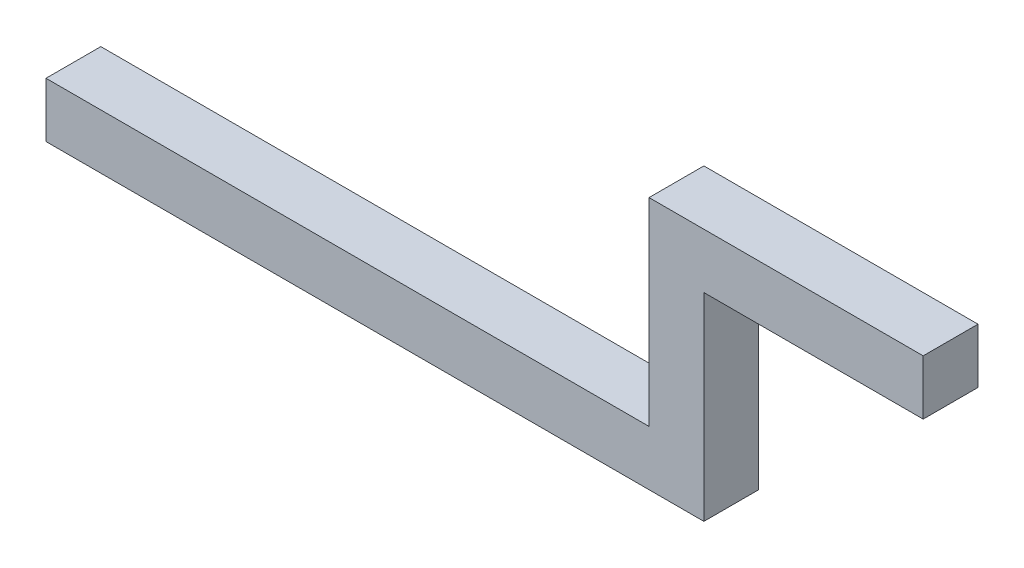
from build123d import *

# Parameters (mm, degrees)
BOSS_EXTRUDE1_DEPTH = 6.35


with BuildPart() as part:
    # Sketch1 → Boss-Extrude1 (new body)
    with BuildSketch(Plane.XY):
        Polygon((0, 23.287828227), (0, 46.24552921), (31.75, 46.24552921), (31.75, 39.89552921), (6.35, 39.89552921), (6.35, 23.287828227), (6.35, 16.937828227), (-69.85, 16.937828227), (-69.85, 23.287828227), align=None)
    extrude(amount=BOSS_EXTRUDE1_DEPTH)


solid = part.part
